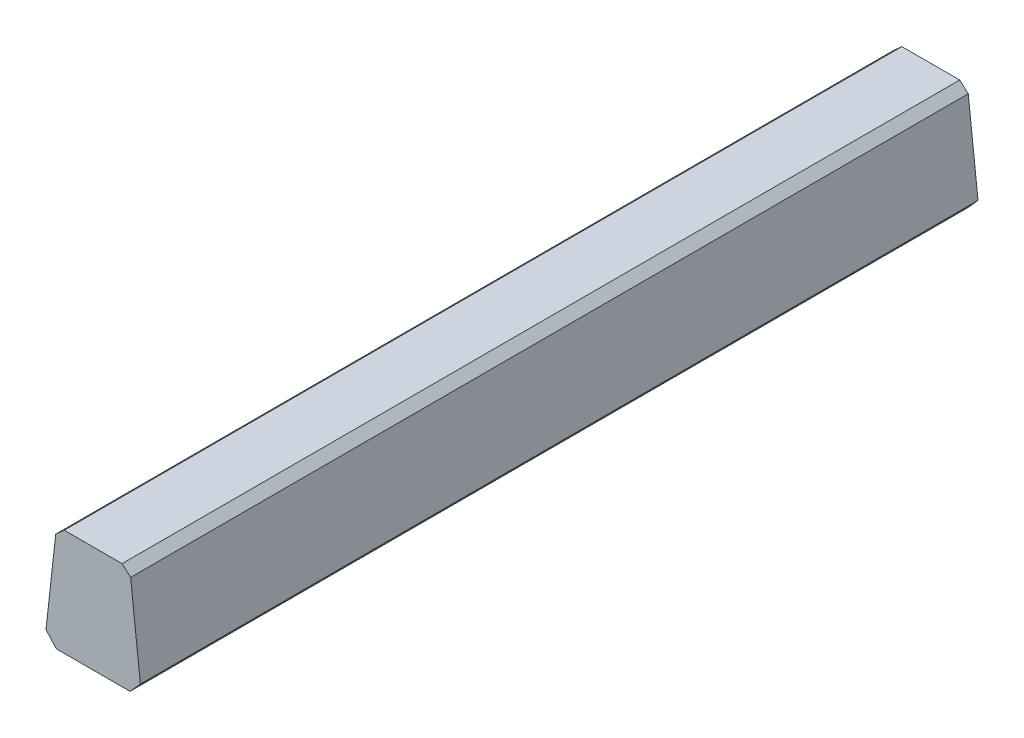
ISO-10303-21;
HEADER;
FILE_DESCRIPTION(('STEP AP214'),'2;1');
FILE_NAME('part.step','',(''),(''),'','','');
FILE_SCHEMA(('AUTOMOTIVE_DESIGN { 1 0 10303 214 1 1 1 1 }'));
ENDSEC;
DATA;
#1=APPLICATION_CONTEXT('core data for automotive mechanical design processes');
#2=APPLICATION_PROTOCOL_DEFINITION('international standard','automotive_design',2000,#1);
#3=PRODUCT_CONTEXT('',#1,'mechanical');
#4=PRODUCT('Part','Part','',(#3));
#5=PRODUCT_RELATED_PRODUCT_CATEGORY('part','',(#4));
#6=PRODUCT_DEFINITION_FORMATION('','',#4);
#7=PRODUCT_DEFINITION_CONTEXT('part definition',#1,'design');
#8=PRODUCT_DEFINITION('design','',#6,#7);
#9=PRODUCT_DEFINITION_SHAPE('','',#8);
#10=(LENGTH_UNIT() NAMED_UNIT(*) SI_UNIT(.MILLI.,.METRE.));
#11=(NAMED_UNIT(*) PLANE_ANGLE_UNIT() SI_UNIT($,.RADIAN.));
#12=(NAMED_UNIT(*) SI_UNIT($,.STERADIAN.) SOLID_ANGLE_UNIT());
#13=UNCERTAINTY_MEASURE_WITH_UNIT(LENGTH_MEASURE(1.E-05),#10,'distance_accuracy_value','');
#14=(GEOMETRIC_REPRESENTATION_CONTEXT(3) GLOBAL_UNCERTAINTY_ASSIGNED_CONTEXT((#13)) GLOBAL_UNIT_ASSIGNED_CONTEXT((#10,
#11,#12)) REPRESENTATION_CONTEXT('',''));
#15=CARTESIAN_POINT('',(0.,0.,0.));
#16=DIRECTION('',(0.,0.,1.));
#17=DIRECTION('',(1.,0.,0.));
#18=AXIS2_PLACEMENT_3D('',#15,#16,#17);
#19=CARTESIAN_POINT('',(-19.25315459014,105.9794696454,782.9));
#20=DIRECTION('',(-0.666991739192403,0.745065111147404,0.));
#21=DIRECTION('',(0.,0.,1.));
#22=AXIS2_PLACEMENT_3D('',#19,#20,#21);
#23=PLANE('',#22);
#24=DIRECTION('',(0.,0.,1.));
#25=VECTOR('',#24,1.);
#26=CARTESIAN_POINT('',(-19.25315459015,105.9794696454,267.9));
#27=LINE('',#26,#25);
#28=CARTESIAN_POINT('',(-19.25315459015,105.9794696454,267.9));
#29=VERTEX_POINT('',#28);
#30=CARTESIAN_POINT('',(-19.25315459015,105.9794696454,698.4));
#31=VERTEX_POINT('',#30);
#32=EDGE_CURVE('E154',#29,#31,#27,.T.);
#33=ORIENTED_EDGE('',*,*,#32,.T.);
#34=DIRECTION('',(0.745065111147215,0.666991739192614,0.));
#35=VECTOR('',#34,1.);
#36=CARTESIAN_POINT('',(-19.25315459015,105.9794696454,698.4));
#37=LINE('',#36,#35);
#38=CARTESIAN_POINT('',(-14.86436821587,109.9083668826,698.4));
#39=VERTEX_POINT('',#38);
#40=EDGE_CURVE('E41',#31,#39,#37,.T.);
#41=ORIENTED_EDGE('',*,*,#40,.T.);
#42=DIRECTION('',(0.,0.,1.));
#43=VECTOR('',#42,1.);
#44=CARTESIAN_POINT('',(-14.86436821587,109.9083668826,267.9));
#45=LINE('',#44,#43);
#46=CARTESIAN_POINT('',(-14.86436821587,109.9083668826,267.9));
#47=VERTEX_POINT('',#46);
#48=EDGE_CURVE('E20',#47,#39,#45,.T.);
#49=ORIENTED_EDGE('',*,*,#48,.F.);
#50=DIRECTION('',(-0.745065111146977,-0.66699173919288,1.06150650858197E-13));
#51=VECTOR('',#50,1.);
#52=CARTESIAN_POINT('',(-14.86436821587,109.9083668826,267.9));
#53=LINE('',#52,#51);
#54=EDGE_CURVE('E10',#47,#29,#53,.T.);
#55=ORIENTED_EDGE('',*,*,#54,.T.);
#56=EDGE_LOOP('',(#33,#41,#49,#55));
#57=FACE_BOUND('',#56,.T.);
#58=ADVANCED_FACE('F16',(#57),#23,.T.);
#59=CARTESIAN_POINT('',(0.,-1.448715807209E-11,267.9));
#60=DIRECTION('',(0.,0.,-1.));
#61=DIRECTION('',(-1.,0.,0.));
#62=AXIS2_PLACEMENT_3D('',#59,#60,#61);
#63=PLANE('',#62);
#64=DIRECTION('',(0.666991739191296,-0.745065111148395,0.));
#65=VECTOR('',#64,1.);
#66=CARTESIAN_POINT('',(-24.24294607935,60.99403123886,267.9));
#67=LINE('',#66,#65);
#68=CARTESIAN_POINT('',(-24.24294607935,60.99403123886,267.9));
#69=VERTEX_POINT('',#68);
#70=CARTESIAN_POINT('',(-18.95904440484,55.09163311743,267.9));
#71=VERTEX_POINT('',#70);
#72=EDGE_CURVE('E145',#69,#71,#67,.T.);
#73=ORIENTED_EDGE('',*,*,#72,.F.);
#74=DIRECTION('',(-0.110244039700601,-0.993904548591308,0.));
#75=VECTOR('',#74,1.);
#76=CARTESIAN_POINT('',(-19.25315459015,105.9794696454,267.9));
#77=LINE('',#76,#75);
#78=EDGE_CURVE('E149',#29,#69,#77,.T.);
#79=ORIENTED_EDGE('',*,*,#78,.F.);
#80=ORIENTED_EDGE('',*,*,#54,.F.);
#81=DIRECTION('',(1.,0.,0.));
#82=VECTOR('',#81,1.);
#83=CARTESIAN_POINT('',(-14.86436821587,109.9083668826,267.9));
#84=LINE('',#83,#82);
#85=CARTESIAN_POINT('',(14.86436821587,109.9083668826,267.9));
#86=VERTEX_POINT('',#85);
#87=EDGE_CURVE('E107',#47,#86,#84,.T.);
#88=ORIENTED_EDGE('',*,*,#87,.T.);
#89=DIRECTION('',(-0.745065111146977,0.66699173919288,-1.15800710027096E-13));
#90=VECTOR('',#89,1.);
#91=CARTESIAN_POINT('',(19.25315459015,105.9794696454,267.9));
#92=LINE('',#91,#90);
#93=CARTESIAN_POINT('',(19.25315459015,105.9794696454,267.9));
#94=VERTEX_POINT('',#93);
#95=EDGE_CURVE('E100',#94,#86,#92,.T.);
#96=ORIENTED_EDGE('',*,*,#95,.F.);
#97=DIRECTION('',(-0.110244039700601,0.993904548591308,0.));
#98=VECTOR('',#97,1.);
#99=CARTESIAN_POINT('',(24.24294607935,60.99403123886,267.9));
#100=LINE('',#99,#98);
#101=CARTESIAN_POINT('',(24.24294607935,60.99403123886,267.9));
#102=VERTEX_POINT('',#101);
#103=EDGE_CURVE('E104',#102,#94,#100,.T.);
#104=ORIENTED_EDGE('',*,*,#103,.F.);
#105=DIRECTION('',(0.666991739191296,0.745065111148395,0.));
#106=VECTOR('',#105,1.);
#107=CARTESIAN_POINT('',(18.95904440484,55.09163311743,267.9));
#108=LINE('',#107,#106);
#109=CARTESIAN_POINT('',(18.95904440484,55.09163311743,267.9));
#110=VERTEX_POINT('',#109);
#111=EDGE_CURVE('E130',#110,#102,#108,.T.);
#112=ORIENTED_EDGE('',*,*,#111,.F.);
#113=DIRECTION('',(-1.,0.,0.));
#114=VECTOR('',#113,1.);
#115=CARTESIAN_POINT('',(18.95904440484,55.09163311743,267.9));
#116=LINE('',#115,#114);
#117=EDGE_CURVE('E27',#110,#71,#116,.T.);
#118=ORIENTED_EDGE('',*,*,#117,.T.);
#119=EDGE_LOOP('',(#73,#79,#80,#88,#96,#104,#112,#118));
#120=FACE_BOUND('',#119,.T.);
#121=ADVANCED_FACE('F102',(#120),#63,.T.);
#122=CARTESIAN_POINT('',(0.,55.0916331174,782.9));
#123=DIRECTION('',(0.,-1.,0.));
#124=DIRECTION('',(0.,0.,-1.));
#125=AXIS2_PLACEMENT_3D('',#122,#123,#124);
#126=PLANE('',#125);
#127=DIRECTION('',(0.,0.,1.));
#128=VECTOR('',#127,1.);
#129=CARTESIAN_POINT('',(-18.95904440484,55.09163311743,267.9));
#130=LINE('',#129,#128);
#131=CARTESIAN_POINT('',(-18.95904440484,55.0916331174,698.4));
#132=VERTEX_POINT('',#131);
#133=EDGE_CURVE('E153',#71,#132,#130,.T.);
#134=ORIENTED_EDGE('',*,*,#133,.F.);
#135=ORIENTED_EDGE('',*,*,#117,.F.);
#136=DIRECTION('',(0.,0.,1.));
#137=VECTOR('',#136,1.);
#138=CARTESIAN_POINT('',(18.95904440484,55.09163311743,267.9));
#139=LINE('',#138,#137);
#140=CARTESIAN_POINT('',(18.95904440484,55.0916331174,698.4));
#141=VERTEX_POINT('',#140);
#142=EDGE_CURVE('E137',#110,#141,#139,.T.);
#143=ORIENTED_EDGE('',*,*,#142,.T.);
#144=DIRECTION('',(1.,0.,0.));
#145=VECTOR('',#144,1.);
#146=CARTESIAN_POINT('',(-18.95904440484,55.0916331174,698.4));
#147=LINE('',#146,#145);
#148=EDGE_CURVE('E148',#132,#141,#147,.T.);
#149=ORIENTED_EDGE('',*,*,#148,.F.);
#150=EDGE_LOOP('',(#134,#135,#143,#149));
#151=FACE_BOUND('',#150,.T.);
#152=ADVANCED_FACE('F283',(#151),#126,.T.);
#153=CARTESIAN_POINT('',(0.,-3.776719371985E-11,698.4));
#154=DIRECTION('',(0.,0.,-1.));
#155=DIRECTION('',(-1.,0.,0.));
#156=AXIS2_PLACEMENT_3D('',#153,#154,#155);
#157=PLANE('',#156);
#158=ORIENTED_EDGE('',*,*,#40,.F.);
#159=DIRECTION('',(0.110244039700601,0.993904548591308,0.));
#160=VECTOR('',#159,1.);
#161=CARTESIAN_POINT('',(-24.24294607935,60.99403123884,698.4));
#162=LINE('',#161,#160);
#163=CARTESIAN_POINT('',(-24.24294607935,60.99403123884,698.4));
#164=VERTEX_POINT('',#163);
#165=EDGE_CURVE('E182',#164,#31,#162,.T.);
#166=ORIENTED_EDGE('',*,*,#165,.F.);
#167=DIRECTION('',(-0.666991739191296,0.745065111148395,0.));
#168=VECTOR('',#167,1.);
#169=CARTESIAN_POINT('',(-18.95904440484,55.0916331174,698.4));
#170=LINE('',#169,#168);
#171=EDGE_CURVE('E155',#132,#164,#170,.T.);
#172=ORIENTED_EDGE('',*,*,#171,.F.);
#173=ORIENTED_EDGE('',*,*,#148,.T.);
#174=DIRECTION('',(-0.666991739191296,-0.745065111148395,0.));
#175=VECTOR('',#174,1.);
#176=CARTESIAN_POINT('',(24.24294607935,60.99403123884,698.4));
#177=LINE('',#176,#175);
#178=CARTESIAN_POINT('',(24.24294607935,60.99403123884,698.4));
#179=VERTEX_POINT('',#178);
#180=EDGE_CURVE('E144',#179,#141,#177,.T.);
#181=ORIENTED_EDGE('',*,*,#180,.F.);
#182=DIRECTION('',(0.110244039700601,-0.993904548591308,0.));
#183=VECTOR('',#182,1.);
#184=CARTESIAN_POINT('',(19.25315459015,105.9794696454,698.4));
#185=LINE('',#184,#183);
#186=CARTESIAN_POINT('',(19.25315459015,105.9794696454,698.4));
#187=VERTEX_POINT('',#186);
#188=EDGE_CURVE('E124',#187,#179,#185,.T.);
#189=ORIENTED_EDGE('',*,*,#188,.F.);
#190=DIRECTION('',(0.745065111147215,-0.666991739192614,0.));
#191=VECTOR('',#190,1.);
#192=CARTESIAN_POINT('',(14.86436821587,109.9083668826,698.4));
#193=LINE('',#192,#191);
#194=CARTESIAN_POINT('',(14.86436821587,109.9083668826,698.4));
#195=VERTEX_POINT('',#194);
#196=EDGE_CURVE('E113',#195,#187,#193,.T.);
#197=ORIENTED_EDGE('',*,*,#196,.F.);
#198=DIRECTION('',(-1.,0.,0.));
#199=VECTOR('',#198,1.);
#200=CARTESIAN_POINT('',(14.86436821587,109.9083668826,698.4));
#201=LINE('',#200,#199);
#202=EDGE_CURVE('E189',#195,#39,#201,.T.);
#203=ORIENTED_EDGE('',*,*,#202,.T.);
#204=EDGE_LOOP('',(#158,#166,#172,#173,#181,#189,#197,#203));
#205=FACE_BOUND('',#204,.T.);
#206=ADVANCED_FACE('F287',(#205),#157,.F.);
#207=CARTESIAN_POINT('',(-14.86436821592,109.9083668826,782.9));
#208=DIRECTION('',(0.,1.,0.));
#209=DIRECTION('',(0.,0.,-1.));
#210=AXIS2_PLACEMENT_3D('',#207,#208,#209);
#211=PLANE('',#210);
#212=ORIENTED_EDGE('',*,*,#48,.T.);
#213=ORIENTED_EDGE('',*,*,#202,.F.);
#214=DIRECTION('',(0.,0.,1.));
#215=VECTOR('',#214,1.);
#216=CARTESIAN_POINT('',(14.86436821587,109.9083668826,267.9));
#217=LINE('',#216,#215);
#218=EDGE_CURVE('E123',#86,#195,#217,.T.);
#219=ORIENTED_EDGE('',*,*,#218,.F.);
#220=ORIENTED_EDGE('',*,*,#87,.F.);
#221=EDGE_LOOP('',(#212,#213,#219,#220));
#222=FACE_BOUND('',#221,.T.);
#223=ADVANCED_FACE('F265',(#222),#211,.T.);
#224=CARTESIAN_POINT('',(19.25315459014,105.9794696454,782.9));
#225=DIRECTION('',(-0.666991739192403,-0.745065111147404,0.));
#226=DIRECTION('',(-0.745065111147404,0.666991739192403,0.));
#227=AXIS2_PLACEMENT_3D('',#224,#225,#226);
#228=PLANE('',#227);
#229=ORIENTED_EDGE('',*,*,#218,.T.);
#230=ORIENTED_EDGE('',*,*,#196,.T.);
#231=DIRECTION('',(0.,0.,1.));
#232=VECTOR('',#231,1.);
#233=CARTESIAN_POINT('',(19.25315459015,105.9794696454,267.9));
#234=LINE('',#233,#232);
#235=EDGE_CURVE('E119',#94,#187,#234,.T.);
#236=ORIENTED_EDGE('',*,*,#235,.F.);
#237=ORIENTED_EDGE('',*,*,#95,.T.);
#238=EDGE_LOOP('',(#229,#230,#236,#237));
#239=FACE_BOUND('',#238,.T.);
#240=ADVANCED_FACE('F126',(#239),#228,.F.);
#241=CARTESIAN_POINT('',(24.24294607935,60.99403123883,782.9));
#242=DIRECTION('',(-0.993904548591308,-0.110244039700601,0.));
#243=DIRECTION('',(-0.110244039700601,0.993904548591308,0.));
#244=AXIS2_PLACEMENT_3D('',#241,#242,#243);
#245=PLANE('',#244);
#246=ORIENTED_EDGE('',*,*,#235,.T.);
#247=ORIENTED_EDGE('',*,*,#188,.T.);
#248=DIRECTION('',(0.,0.,1.));
#249=VECTOR('',#248,1.);
#250=CARTESIAN_POINT('',(24.24294607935,60.99403123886,267.9));
#251=LINE('',#250,#249);
#252=EDGE_CURVE('E121',#102,#179,#251,.T.);
#253=ORIENTED_EDGE('',*,*,#252,.F.);
#254=ORIENTED_EDGE('',*,*,#103,.T.);
#255=EDGE_LOOP('',(#246,#247,#253,#254));
#256=FACE_BOUND('',#255,.T.);
#257=ADVANCED_FACE('F118',(#256),#245,.F.);
#258=CARTESIAN_POINT('',(18.95904440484,55.0916331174,782.9));
#259=DIRECTION('',(-0.745065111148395,0.666991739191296,0.));
#260=DIRECTION('',(0.,0.,1.));
#261=AXIS2_PLACEMENT_3D('',#258,#259,#260);
#262=PLANE('',#261);
#263=ORIENTED_EDGE('',*,*,#252,.T.);
#264=ORIENTED_EDGE('',*,*,#180,.T.);
#265=ORIENTED_EDGE('',*,*,#142,.F.);
#266=ORIENTED_EDGE('',*,*,#111,.T.);
#267=EDGE_LOOP('',(#263,#264,#265,#266));
#268=FACE_BOUND('',#267,.T.);
#269=ADVANCED_FACE('F272',(#268),#262,.F.);
#270=CARTESIAN_POINT('',(-18.95904440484,55.0916331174,782.9));
#271=DIRECTION('',(-0.745065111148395,-0.666991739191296,0.));
#272=DIRECTION('',(-0.666991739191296,0.745065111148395,0.));
#273=AXIS2_PLACEMENT_3D('',#270,#271,#272);
#274=PLANE('',#273);
#275=ORIENTED_EDGE('',*,*,#133,.T.);
#276=ORIENTED_EDGE('',*,*,#171,.T.);
#277=DIRECTION('',(0.,0.,1.));
#278=VECTOR('',#277,1.);
#279=CARTESIAN_POINT('',(-24.24294607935,60.99403123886,267.9));
#280=LINE('',#279,#278);
#281=EDGE_CURVE('E178',#69,#164,#280,.T.);
#282=ORIENTED_EDGE('',*,*,#281,.F.);
#283=ORIENTED_EDGE('',*,*,#72,.T.);
#284=EDGE_LOOP('',(#275,#276,#282,#283));
#285=FACE_BOUND('',#284,.T.);
#286=ADVANCED_FACE('F18',(#285),#274,.T.);
#287=CARTESIAN_POINT('',(-24.24294607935,60.99403123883,782.9));
#288=DIRECTION('',(-0.993904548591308,0.110244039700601,0.));
#289=DIRECTION('',(0.,0.,1.));
#290=AXIS2_PLACEMENT_3D('',#287,#288,#289);
#291=PLANE('',#290);
#292=ORIENTED_EDGE('',*,*,#281,.T.);
#293=ORIENTED_EDGE('',*,*,#165,.T.);
#294=ORIENTED_EDGE('',*,*,#32,.F.);
#295=ORIENTED_EDGE('',*,*,#78,.T.);
#296=EDGE_LOOP('',(#292,#293,#294,#295));
#297=FACE_BOUND('',#296,.T.);
#298=ADVANCED_FACE('F250',(#297),#291,.T.);
#299=CLOSED_SHELL('',(#58,#121,#152,#206,#223,#240,#257,#269,#286,#298));
#300=MANIFOLD_SOLID_BREP('B1',#299);
#301=ADVANCED_BREP_SHAPE_REPRESENTATION('',(#18,#300),#14);
#302=SHAPE_DEFINITION_REPRESENTATION(#9,#301);
ENDSEC;
END-ISO-10303-21;
